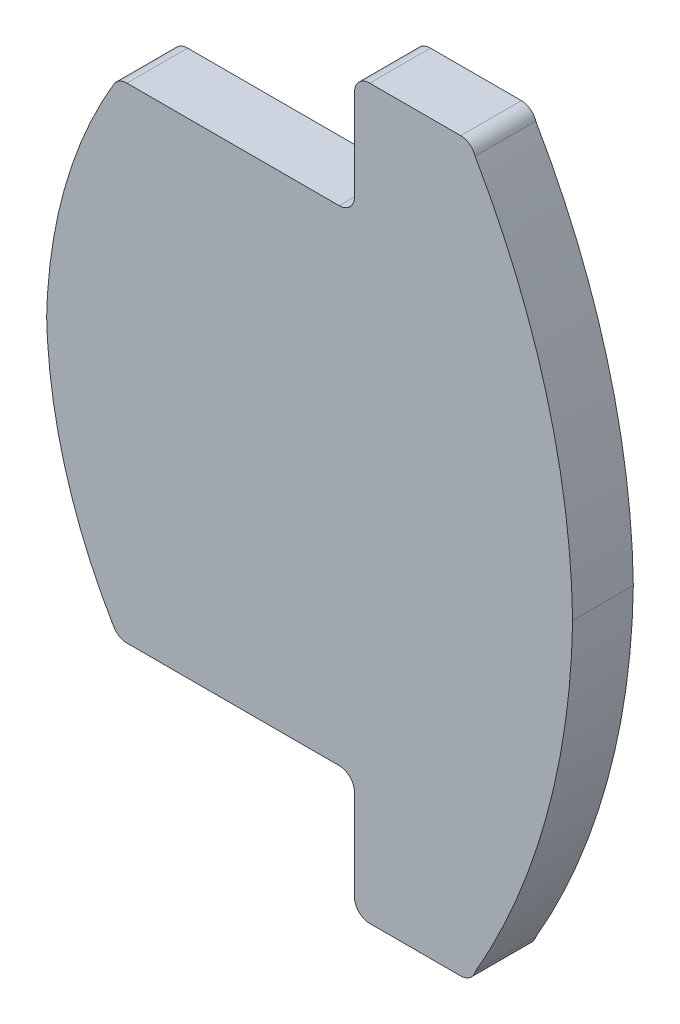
ISO-10303-21;
HEADER;
FILE_DESCRIPTION(('STEP AP214'),'2;1');
FILE_NAME('part.step','',(''),(''),'','','');
FILE_SCHEMA(('AUTOMOTIVE_DESIGN { 1 0 10303 214 1 1 1 1 }'));
ENDSEC;
DATA;
#1=APPLICATION_CONTEXT('core data for automotive mechanical design processes');
#2=APPLICATION_PROTOCOL_DEFINITION('international standard','automotive_design',2000,#1);
#3=PRODUCT_CONTEXT('',#1,'mechanical');
#4=PRODUCT('Part','Part','',(#3));
#5=PRODUCT_RELATED_PRODUCT_CATEGORY('part','',(#4));
#6=PRODUCT_DEFINITION_FORMATION('','',#4);
#7=PRODUCT_DEFINITION_CONTEXT('part definition',#1,'design');
#8=PRODUCT_DEFINITION('design','',#6,#7);
#9=PRODUCT_DEFINITION_SHAPE('','',#8);
#10=(LENGTH_UNIT() NAMED_UNIT(*) SI_UNIT(.MILLI.,.METRE.));
#11=(NAMED_UNIT(*) PLANE_ANGLE_UNIT() SI_UNIT($,.RADIAN.));
#12=(NAMED_UNIT(*) SI_UNIT($,.STERADIAN.) SOLID_ANGLE_UNIT());
#13=UNCERTAINTY_MEASURE_WITH_UNIT(LENGTH_MEASURE(1.E-05),#10,'distance_accuracy_value','');
#14=(GEOMETRIC_REPRESENTATION_CONTEXT(3) GLOBAL_UNCERTAINTY_ASSIGNED_CONTEXT((#13)) GLOBAL_UNIT_ASSIGNED_CONTEXT((#10,
#11,#12)) REPRESENTATION_CONTEXT('',''));
#15=CARTESIAN_POINT('',(0.,0.,0.));
#16=DIRECTION('',(0.,0.,1.));
#17=DIRECTION('',(1.,0.,0.));
#18=AXIS2_PLACEMENT_3D('',#15,#16,#17);
#19=CARTESIAN_POINT('',(6.3098886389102,-53.930587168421,12.7));
#20=DIRECTION('',(0.,0.,-1.));
#21=DIRECTION('',(-1.,0.,0.));
#22=AXIS2_PLACEMENT_3D('',#19,#20,#21);
#23=CYLINDRICAL_SURFACE('',#22,3.20040001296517);
#24=DIRECTION('',(0.,0.,1.));
#25=VECTOR('',#24,1.);
#26=CARTESIAN_POINT('',(6.30988865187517,-50.7301871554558,12.7));
#27=LINE('',#26,#25);
#28=CARTESIAN_POINT('',(6.30988865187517,-50.7301871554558,12.7));
#29=VERTEX_POINT('',#28);
#30=CARTESIAN_POINT('',(6.30988865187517,-50.7301871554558,25.4));
#31=VERTEX_POINT('',#30);
#32=EDGE_CURVE('E12',#29,#31,#27,.T.);
#33=ORIENTED_EDGE('',*,*,#32,.F.);
#34=CARTESIAN_POINT('',(6.3098886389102,-53.930587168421,12.7));
#35=DIRECTION('',(0.,0.,-1.));
#36=DIRECTION('',(-1.,0.,0.));
#37=AXIS2_PLACEMENT_3D('',#34,#35,#36);
#38=CIRCLE('',#37,3.20040001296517);
#39=CARTESIAN_POINT('',(9.51028865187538,-53.9305871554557,12.7));
#40=VERTEX_POINT('',#39);
#41=EDGE_CURVE('E259',#29,#40,#38,.T.);
#42=ORIENTED_EDGE('',*,*,#41,.T.);
#43=DIRECTION('',(0.,0.,1.));
#44=VECTOR('',#43,1.);
#45=CARTESIAN_POINT('',(9.51028865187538,-53.9305871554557,12.7));
#46=LINE('',#45,#44);
#47=CARTESIAN_POINT('',(9.51028865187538,-53.9305871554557,25.4));
#48=VERTEX_POINT('',#47);
#49=EDGE_CURVE('E31',#40,#48,#46,.T.);
#50=ORIENTED_EDGE('',*,*,#49,.T.);
#51=CARTESIAN_POINT('',(6.3098886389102,-53.930587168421,25.4));
#52=DIRECTION('',(0.,0.,-1.));
#53=DIRECTION('',(-1.,0.,0.));
#54=AXIS2_PLACEMENT_3D('',#51,#52,#53);
#55=CIRCLE('',#54,3.20040001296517);
#56=EDGE_CURVE('E268',#31,#48,#55,.T.);
#57=ORIENTED_EDGE('',*,*,#56,.F.);
#58=EDGE_LOOP('',(#33,#42,#50,#57));
#59=FACE_BOUND('',#58,.T.);
#60=ADVANCED_FACE('F20',(#59),#23,.F.);
#61=CARTESIAN_POINT('',(9.51028865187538,-72.9551871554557,12.7));
#62=DIRECTION('',(1.,0.,0.));
#63=DIRECTION('',(0.,-1.,0.));
#64=AXIS2_PLACEMENT_3D('',#61,#62,#63);
#65=PLANE('',#64);
#66=ORIENTED_EDGE('',*,*,#49,.F.);
#67=DIRECTION('',(0.,-1.,0.));
#68=VECTOR('',#67,1.);
#69=CARTESIAN_POINT('',(9.51028865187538,-72.9551871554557,12.7));
#70=LINE('',#69,#68);
#71=CARTESIAN_POINT('',(9.51028865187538,-72.9551871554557,12.7));
#72=VERTEX_POINT('',#71);
#73=EDGE_CURVE('E255',#40,#72,#70,.T.);
#74=ORIENTED_EDGE('',*,*,#73,.T.);
#75=DIRECTION('',(0.,0.,1.));
#76=VECTOR('',#75,1.);
#77=CARTESIAN_POINT('',(9.51028865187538,-72.9551871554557,12.7));
#78=LINE('',#77,#76);
#79=CARTESIAN_POINT('',(9.51028865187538,-72.9551871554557,25.4));
#80=VERTEX_POINT('',#79);
#81=EDGE_CURVE('E407',#72,#80,#78,.T.);
#82=ORIENTED_EDGE('',*,*,#81,.T.);
#83=DIRECTION('',(0.,1.,0.));
#84=VECTOR('',#83,1.);
#85=CARTESIAN_POINT('',(9.51028865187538,-47.5551871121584,25.4));
#86=LINE('',#85,#84);
#87=EDGE_CURVE('E272',#48,#80,#86,.F.);
#88=ORIENTED_EDGE('',*,*,#87,.F.);
#89=EDGE_LOOP('',(#66,#74,#82,#88));
#90=FACE_BOUND('',#89,.T.);
#91=ADVANCED_FACE('F421',(#90),#65,.F.);
#92=CARTESIAN_POINT('',(12.6852886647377,-72.9551871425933,12.7));
#93=DIRECTION('',(0.,0.,1.));
#94=DIRECTION('',(1.,0.,0.));
#95=AXIS2_PLACEMENT_3D('',#92,#93,#94);
#96=CYLINDRICAL_SURFACE('',#95,3.17500001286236);
#97=ORIENTED_EDGE('',*,*,#81,.F.);
#98=CARTESIAN_POINT('',(12.6852886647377,-72.9551871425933,12.7));
#99=DIRECTION('',(0.,0.,1.));
#100=DIRECTION('',(-1.,0.,0.));
#101=AXIS2_PLACEMENT_3D('',#98,#99,#100);
#102=CIRCLE('',#101,3.17500001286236);
#103=CARTESIAN_POINT('',(12.6852886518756,-76.1301871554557,12.7));
#104=VERTEX_POINT('',#103);
#105=EDGE_CURVE('E251',#72,#104,#102,.T.);
#106=ORIENTED_EDGE('',*,*,#105,.T.);
#107=DIRECTION('',(0.,0.,1.));
#108=VECTOR('',#107,1.);
#109=CARTESIAN_POINT('',(12.6852886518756,-76.1301871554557,12.7));
#110=LINE('',#109,#108);
#111=CARTESIAN_POINT('',(12.6852886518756,-76.1301871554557,25.4));
#112=VERTEX_POINT('',#111);
#113=EDGE_CURVE('E404',#104,#112,#110,.T.);
#114=ORIENTED_EDGE('',*,*,#113,.T.);
#115=CARTESIAN_POINT('',(12.6852886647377,-72.9551871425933,25.4));
#116=DIRECTION('',(0.,0.,1.));
#117=DIRECTION('',(1.,0.,0.));
#118=AXIS2_PLACEMENT_3D('',#115,#116,#117);
#119=CIRCLE('',#118,3.17500001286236);
#120=EDGE_CURVE('E278',#80,#112,#119,.T.);
#121=ORIENTED_EDGE('',*,*,#120,.F.);
#122=EDGE_LOOP('',(#97,#106,#114,#121));
#123=FACE_BOUND('',#122,.T.);
#124=ADVANCED_FACE('F429',(#123),#96,.T.);
#125=CARTESIAN_POINT('',(31.7352886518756,-76.1301871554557,12.7));
#126=DIRECTION('',(0.,1.,0.));
#127=DIRECTION('',(1.,0.,0.));
#128=AXIS2_PLACEMENT_3D('',#125,#126,#127);
#129=PLANE('',#128);
#130=ORIENTED_EDGE('',*,*,#113,.F.);
#131=DIRECTION('',(1.,0.,0.));
#132=VECTOR('',#131,1.);
#133=CARTESIAN_POINT('',(31.7352886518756,-76.1301871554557,12.7));
#134=LINE('',#133,#132);
#135=CARTESIAN_POINT('',(31.7352886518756,-76.1301871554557,12.7));
#136=VERTEX_POINT('',#135);
#137=EDGE_CURVE('E248',#104,#136,#134,.T.);
#138=ORIENTED_EDGE('',*,*,#137,.T.);
#139=DIRECTION('',(0.,0.,1.));
#140=VECTOR('',#139,1.);
#141=CARTESIAN_POINT('',(31.7352886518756,-76.1301871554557,12.7));
#142=LINE('',#141,#140);
#143=CARTESIAN_POINT('',(31.7352886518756,-76.1301871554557,25.4));
#144=VERTEX_POINT('',#143);
#145=EDGE_CURVE('E401',#136,#144,#142,.T.);
#146=ORIENTED_EDGE('',*,*,#145,.T.);
#147=DIRECTION('',(-1.,0.,0.));
#148=VECTOR('',#147,1.);
#149=CARTESIAN_POINT('',(-38.1147114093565,-76.1301871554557,25.4));
#150=LINE('',#149,#148);
#151=EDGE_CURVE('E282',#112,#144,#150,.F.);
#152=ORIENTED_EDGE('',*,*,#151,.F.);
#153=EDGE_LOOP('',(#130,#138,#146,#152));
#154=FACE_BOUND('',#153,.T.);
#155=ADVANCED_FACE('F432',(#154),#129,.F.);
#156=CARTESIAN_POINT('',(31.7126542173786,-72.9552635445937,12.7));
#157=DIRECTION('',(0.,0.,1.));
#158=DIRECTION('',(1.,0.,0.));
#159=AXIS2_PLACEMENT_3D('',#156,#157,#158);
#160=CYLINDRICAL_SURFACE('',#159,3.17500429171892);
#161=ORIENTED_EDGE('',*,*,#145,.F.);
#162=CARTESIAN_POINT('',(31.7126542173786,-72.9552635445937,12.7));
#163=DIRECTION('',(0.,0.,1.));
#164=DIRECTION('',(-1.,0.,0.));
#165=AXIS2_PLACEMENT_3D('',#162,#163,#164);
#166=CIRCLE('',#165,3.17500429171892);
#167=CARTESIAN_POINT('',(34.7442597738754,-73.8986722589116,12.7));
#168=VERTEX_POINT('',#167);
#169=EDGE_CURVE('E240',#136,#168,#166,.T.);
#170=ORIENTED_EDGE('',*,*,#169,.T.);
#171=DIRECTION('',(0.,0.,1.));
#172=VECTOR('',#171,1.);
#173=CARTESIAN_POINT('',(34.7442597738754,-73.8986722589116,12.7));
#174=LINE('',#173,#172);
#175=CARTESIAN_POINT('',(34.7442597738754,-73.8986722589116,25.4));
#176=VERTEX_POINT('',#175);
#177=EDGE_CURVE('E399',#168,#176,#174,.T.);
#178=ORIENTED_EDGE('',*,*,#177,.T.);
#179=CARTESIAN_POINT('',(31.7126542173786,-72.9552635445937,25.4));
#180=DIRECTION('',(0.,0.,1.));
#181=DIRECTION('',(1.,0.,0.));
#182=AXIS2_PLACEMENT_3D('',#179,#180,#181);
#183=CIRCLE('',#182,3.17500429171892);
#184=EDGE_CURVE('E284',#144,#176,#183,.T.);
#185=ORIENTED_EDGE('',*,*,#184,.F.);
#186=EDGE_LOOP('',(#161,#170,#178,#185));
#187=FACE_BOUND('',#186,.T.);
#188=ADVANCED_FACE('F438',(#187),#160,.T.);
#189=CARTESIAN_POINT('',(-97.2343581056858,2.30765966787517,12.7));
#190=DIRECTION('',(0.,0.,1.));
#191=DIRECTION('',(1.,0.,0.));
#192=AXIS2_PLACEMENT_3D('',#189,#190,#191);
#193=CYLINDRICAL_SURFACE('',#192,152.400001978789);
#194=ORIENTED_EDGE('',*,*,#177,.F.);
#195=CARTESIAN_POINT('',(-97.2343581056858,2.30765966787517,12.7));
#196=DIRECTION('',(0.,0.,1.));
#197=DIRECTION('',(-1.,0.,0.));
#198=AXIS2_PLACEMENT_3D('',#195,#196,#197);
#199=CIRCLE('',#198,152.400001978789);
#200=CARTESIAN_POINT('',(55.14817143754,0.,12.7));
#201=VERTEX_POINT('',#200);
#202=EDGE_CURVE('E236',#168,#201,#199,.T.);
#203=ORIENTED_EDGE('',*,*,#202,.T.);
#204=DIRECTION('',(0.,0.,1.));
#205=VECTOR('',#204,1.);
#206=CARTESIAN_POINT('',(55.14817143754,0.,12.7));
#207=LINE('',#206,#205);
#208=CARTESIAN_POINT('',(55.14817143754,0.,25.4));
#209=VERTEX_POINT('',#208);
#210=EDGE_CURVE('E391',#201,#209,#207,.T.);
#211=ORIENTED_EDGE('',*,*,#210,.T.);
#212=CARTESIAN_POINT('',(-97.2343581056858,2.30765966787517,25.4));
#213=DIRECTION('',(0.,0.,1.));
#214=DIRECTION('',(1.,0.,0.));
#215=AXIS2_PLACEMENT_3D('',#212,#213,#214);
#216=CIRCLE('',#215,152.400001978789);
#217=EDGE_CURVE('E288',#176,#209,#216,.T.);
#218=ORIENTED_EDGE('',*,*,#217,.F.);
#219=EDGE_LOOP('',(#194,#203,#211,#218));
#220=FACE_BOUND('',#219,.T.);
#221=ADVANCED_FACE('F444',(#220),#193,.T.);
#222=CARTESIAN_POINT('',(-97.2343581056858,-2.30765966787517,12.7));
#223=DIRECTION('',(0.,0.,1.));
#224=DIRECTION('',(1.,0.,0.));
#225=AXIS2_PLACEMENT_3D('',#222,#223,#224);
#226=CYLINDRICAL_SURFACE('',#225,152.400001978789);
#227=ORIENTED_EDGE('',*,*,#210,.F.);
#228=CARTESIAN_POINT('',(-97.2343581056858,-2.30765966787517,12.7));
#229=DIRECTION('',(0.,0.,1.));
#230=DIRECTION('',(1.,0.,0.));
#231=AXIS2_PLACEMENT_3D('',#228,#229,#230);
#232=CIRCLE('',#231,152.400001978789);
#233=CARTESIAN_POINT('',(34.7442597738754,73.8986722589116,12.7));
#234=VERTEX_POINT('',#233);
#235=EDGE_CURVE('E232',#201,#234,#232,.T.);
#236=ORIENTED_EDGE('',*,*,#235,.T.);
#237=DIRECTION('',(0.,0.,1.));
#238=VECTOR('',#237,1.);
#239=CARTESIAN_POINT('',(34.7442597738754,73.8986722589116,12.7));
#240=LINE('',#239,#238);
#241=CARTESIAN_POINT('',(34.7442597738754,73.8986722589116,25.4));
#242=VERTEX_POINT('',#241);
#243=EDGE_CURVE('E388',#234,#242,#240,.T.);
#244=ORIENTED_EDGE('',*,*,#243,.T.);
#245=CARTESIAN_POINT('',(-97.2343581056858,-2.30765966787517,25.4));
#246=DIRECTION('',(0.,0.,1.));
#247=DIRECTION('',(1.,0.,0.));
#248=AXIS2_PLACEMENT_3D('',#245,#246,#247);
#249=CIRCLE('',#248,152.400001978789);
#250=EDGE_CURVE('E292',#209,#242,#249,.T.);
#251=ORIENTED_EDGE('',*,*,#250,.F.);
#252=EDGE_LOOP('',(#227,#236,#244,#251));
#253=FACE_BOUND('',#252,.T.);
#254=ADVANCED_FACE('F446',(#253),#226,.T.);
#255=CARTESIAN_POINT('',(31.7126542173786,72.9552635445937,12.7));
#256=DIRECTION('',(0.,0.,1.));
#257=DIRECTION('',(1.,0.,0.));
#258=AXIS2_PLACEMENT_3D('',#255,#256,#257);
#259=CYLINDRICAL_SURFACE('',#258,3.17500429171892);
#260=ORIENTED_EDGE('',*,*,#243,.F.);
#261=CARTESIAN_POINT('',(31.7126542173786,72.9552635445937,12.7));
#262=DIRECTION('',(0.,0.,1.));
#263=DIRECTION('',(1.,0.,0.));
#264=AXIS2_PLACEMENT_3D('',#261,#262,#263);
#265=CIRCLE('',#264,3.17500429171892);
#266=CARTESIAN_POINT('',(31.7352886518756,76.1301871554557,12.7));
#267=VERTEX_POINT('',#266);
#268=EDGE_CURVE('E229',#234,#267,#265,.T.);
#269=ORIENTED_EDGE('',*,*,#268,.T.);
#270=DIRECTION('',(0.,0.,1.));
#271=VECTOR('',#270,1.);
#272=CARTESIAN_POINT('',(31.7352886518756,76.1301871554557,12.7));
#273=LINE('',#272,#271);
#274=CARTESIAN_POINT('',(31.7352886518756,76.1301871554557,25.4));
#275=VERTEX_POINT('',#274);
#276=EDGE_CURVE('E385',#267,#275,#273,.T.);
#277=ORIENTED_EDGE('',*,*,#276,.T.);
#278=CARTESIAN_POINT('',(31.7126542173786,72.9552635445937,25.4));
#279=DIRECTION('',(0.,0.,1.));
#280=DIRECTION('',(1.,0.,0.));
#281=AXIS2_PLACEMENT_3D('',#278,#279,#280);
#282=CIRCLE('',#281,3.17500429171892);
#283=EDGE_CURVE('E300',#242,#275,#282,.T.);
#284=ORIENTED_EDGE('',*,*,#283,.F.);
#285=EDGE_LOOP('',(#260,#269,#277,#284));
#286=FACE_BOUND('',#285,.T.);
#287=ADVANCED_FACE('F452',(#286),#259,.T.);
#288=CARTESIAN_POINT('',(31.7352886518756,76.1301871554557,12.7));
#289=DIRECTION('',(0.,-1.,0.));
#290=DIRECTION('',(-1.,0.,0.));
#291=AXIS2_PLACEMENT_3D('',#288,#289,#290);
#292=PLANE('',#291);
#293=ORIENTED_EDGE('',*,*,#276,.F.);
#294=DIRECTION('',(-1.,0.,0.));
#295=VECTOR('',#294,1.);
#296=CARTESIAN_POINT('',(31.7352886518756,76.1301871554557,12.7));
#297=LINE('',#296,#295);
#298=CARTESIAN_POINT('',(12.6852886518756,76.1301871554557,12.7));
#299=VERTEX_POINT('',#298);
#300=EDGE_CURVE('E221',#267,#299,#297,.T.);
#301=ORIENTED_EDGE('',*,*,#300,.T.);
#302=DIRECTION('',(0.,0.,1.));
#303=VECTOR('',#302,1.);
#304=CARTESIAN_POINT('',(12.6852886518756,76.1301871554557,12.7));
#305=LINE('',#304,#303);
#306=CARTESIAN_POINT('',(12.6852886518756,76.1301871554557,25.4));
#307=VERTEX_POINT('',#306);
#308=EDGE_CURVE('E383',#299,#307,#305,.T.);
#309=ORIENTED_EDGE('',*,*,#308,.T.);
#310=DIRECTION('',(-1.,0.,0.));
#311=VECTOR('',#310,1.);
#312=CARTESIAN_POINT('',(-38.1147114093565,76.1301871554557,25.4));
#313=LINE('',#312,#311);
#314=EDGE_CURVE('E303',#275,#307,#313,.T.);
#315=ORIENTED_EDGE('',*,*,#314,.F.);
#316=EDGE_LOOP('',(#293,#301,#309,#315));
#317=FACE_BOUND('',#316,.T.);
#318=ADVANCED_FACE('F457',(#317),#292,.F.);
#319=CARTESIAN_POINT('',(12.6852886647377,72.9551871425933,12.7));
#320=DIRECTION('',(0.,0.,1.));
#321=DIRECTION('',(1.,0.,0.));
#322=AXIS2_PLACEMENT_3D('',#319,#320,#321);
#323=CYLINDRICAL_SURFACE('',#322,3.17500001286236);
#324=ORIENTED_EDGE('',*,*,#308,.F.);
#325=CARTESIAN_POINT('',(12.6852886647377,72.9551871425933,12.7));
#326=DIRECTION('',(0.,0.,1.));
#327=DIRECTION('',(1.,0.,0.));
#328=AXIS2_PLACEMENT_3D('',#325,#326,#327);
#329=CIRCLE('',#328,3.17500001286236);
#330=CARTESIAN_POINT('',(9.51028865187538,72.9551871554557,12.7));
#331=VERTEX_POINT('',#330);
#332=EDGE_CURVE('E217',#299,#331,#329,.T.);
#333=ORIENTED_EDGE('',*,*,#332,.T.);
#334=DIRECTION('',(0.,0.,1.));
#335=VECTOR('',#334,1.);
#336=CARTESIAN_POINT('',(9.51028865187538,72.9551871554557,12.7));
#337=LINE('',#336,#335);
#338=CARTESIAN_POINT('',(9.51028865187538,72.9551871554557,25.4));
#339=VERTEX_POINT('',#338);
#340=EDGE_CURVE('E375',#331,#339,#337,.T.);
#341=ORIENTED_EDGE('',*,*,#340,.T.);
#342=CARTESIAN_POINT('',(12.6852886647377,72.9551871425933,25.4));
#343=DIRECTION('',(0.,0.,1.));
#344=DIRECTION('',(1.,0.,0.));
#345=AXIS2_PLACEMENT_3D('',#342,#343,#344);
#346=CIRCLE('',#345,3.17500001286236);
#347=EDGE_CURVE('E307',#307,#339,#346,.T.);
#348=ORIENTED_EDGE('',*,*,#347,.F.);
#349=EDGE_LOOP('',(#324,#333,#341,#348));
#350=FACE_BOUND('',#349,.T.);
#351=ADVANCED_FACE('F459',(#350),#323,.T.);
#352=CARTESIAN_POINT('',(9.51028865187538,72.9551871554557,12.7));
#353=DIRECTION('',(1.,0.,0.));
#354=DIRECTION('',(0.,-1.,0.));
#355=AXIS2_PLACEMENT_3D('',#352,#353,#354);
#356=PLANE('',#355);
#357=ORIENTED_EDGE('',*,*,#340,.F.);
#358=DIRECTION('',(0.,-1.,0.));
#359=VECTOR('',#358,1.);
#360=CARTESIAN_POINT('',(9.51028865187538,72.9551871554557,12.7));
#361=LINE('',#360,#359);
#362=CARTESIAN_POINT('',(9.51028865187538,53.9305871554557,12.7));
#363=VERTEX_POINT('',#362);
#364=EDGE_CURVE('E213',#331,#363,#361,.T.);
#365=ORIENTED_EDGE('',*,*,#364,.T.);
#366=DIRECTION('',(0.,0.,1.));
#367=VECTOR('',#366,1.);
#368=CARTESIAN_POINT('',(9.51028865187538,53.9305871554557,12.7));
#369=LINE('',#368,#367);
#370=CARTESIAN_POINT('',(9.51028865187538,53.9305871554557,25.4));
#371=VERTEX_POINT('',#370);
#372=EDGE_CURVE('E372',#363,#371,#369,.T.);
#373=ORIENTED_EDGE('',*,*,#372,.T.);
#374=DIRECTION('',(0.,1.,0.));
#375=VECTOR('',#374,1.);
#376=CARTESIAN_POINT('',(9.51028865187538,-47.5551871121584,25.4));
#377=LINE('',#376,#375);
#378=EDGE_CURVE('E311',#339,#371,#377,.F.);
#379=ORIENTED_EDGE('',*,*,#378,.F.);
#380=EDGE_LOOP('',(#357,#365,#373,#379));
#381=FACE_BOUND('',#380,.T.);
#382=ADVANCED_FACE('F464',(#381),#356,.F.);
#383=CARTESIAN_POINT('',(6.3098886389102,53.930587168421,12.7));
#384=DIRECTION('',(0.,0.,-1.));
#385=DIRECTION('',(-1.,0.,0.));
#386=AXIS2_PLACEMENT_3D('',#383,#384,#385);
#387=CYLINDRICAL_SURFACE('',#386,3.20040001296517);
#388=ORIENTED_EDGE('',*,*,#372,.F.);
#389=CARTESIAN_POINT('',(6.3098886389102,53.930587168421,12.7));
#390=DIRECTION('',(0.,0.,-1.));
#391=DIRECTION('',(1.,0.,0.));
#392=AXIS2_PLACEMENT_3D('',#389,#390,#391);
#393=CIRCLE('',#392,3.20040001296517);
#394=CARTESIAN_POINT('',(6.30988865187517,50.7301871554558,12.7));
#395=VERTEX_POINT('',#394);
#396=EDGE_CURVE('E210',#363,#395,#393,.T.);
#397=ORIENTED_EDGE('',*,*,#396,.T.);
#398=DIRECTION('',(0.,0.,1.));
#399=VECTOR('',#398,1.);
#400=CARTESIAN_POINT('',(6.30988865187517,50.7301871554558,12.7));
#401=LINE('',#400,#399);
#402=CARTESIAN_POINT('',(6.30988865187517,50.7301871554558,25.4));
#403=VERTEX_POINT('',#402);
#404=EDGE_CURVE('E369',#395,#403,#401,.T.);
#405=ORIENTED_EDGE('',*,*,#404,.T.);
#406=CARTESIAN_POINT('',(6.3098886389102,53.930587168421,25.4));
#407=DIRECTION('',(0.,0.,-1.));
#408=DIRECTION('',(-1.,0.,0.));
#409=AXIS2_PLACEMENT_3D('',#406,#407,#408);
#410=CIRCLE('',#409,3.20040001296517);
#411=EDGE_CURVE('E317',#371,#403,#410,.T.);
#412=ORIENTED_EDGE('',*,*,#411,.F.);
#413=EDGE_LOOP('',(#388,#397,#405,#412));
#414=FACE_BOUND('',#413,.T.);
#415=ADVANCED_FACE('F470',(#414),#387,.F.);
#416=CARTESIAN_POINT('',(6.30988865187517,50.7301871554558,12.7));
#417=DIRECTION('',(0.,-1.,0.));
#418=DIRECTION('',(-1.,0.,0.));
#419=AXIS2_PLACEMENT_3D('',#416,#417,#418);
#420=PLANE('',#419);
#421=ORIENTED_EDGE('',*,*,#404,.F.);
#422=DIRECTION('',(-1.,0.,0.));
#423=VECTOR('',#422,1.);
#424=CARTESIAN_POINT('',(6.30988865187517,50.7301871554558,12.7));
#425=LINE('',#424,#423);
#426=CARTESIAN_POINT('',(-38.1147113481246,50.7301871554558,12.7));
#427=VERTEX_POINT('',#426);
#428=EDGE_CURVE('E202',#395,#427,#425,.T.);
#429=ORIENTED_EDGE('',*,*,#428,.T.);
#430=DIRECTION('',(0.,0.,1.));
#431=VECTOR('',#430,1.);
#432=CARTESIAN_POINT('',(-38.1147113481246,50.7301871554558,12.7));
#433=LINE('',#432,#431);
#434=CARTESIAN_POINT('',(-38.1147113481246,50.7301871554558,25.4));
#435=VERTEX_POINT('',#434);
#436=EDGE_CURVE('E367',#427,#435,#433,.T.);
#437=ORIENTED_EDGE('',*,*,#436,.T.);
#438=DIRECTION('',(-1.,0.,0.));
#439=VECTOR('',#438,1.);
#440=CARTESIAN_POINT('',(-38.1147114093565,50.7301871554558,25.4));
#441=LINE('',#440,#439);
#442=EDGE_CURVE('E320',#403,#435,#441,.T.);
#443=ORIENTED_EDGE('',*,*,#442,.F.);
#444=EDGE_LOOP('',(#421,#429,#437,#443));
#445=FACE_BOUND('',#444,.T.);
#446=ADVANCED_FACE('F473',(#445),#420,.F.);
#447=CARTESIAN_POINT('',(-38.1147114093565,47.5551871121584,12.7));
#448=DIRECTION('',(0.,0.,1.));
#449=DIRECTION('',(1.,0.,0.));
#450=AXIS2_PLACEMENT_3D('',#447,#448,#449);
#451=CYLINDRICAL_SURFACE('',#450,3.17500004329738);
#452=ORIENTED_EDGE('',*,*,#436,.F.);
#453=CARTESIAN_POINT('',(-38.1147114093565,47.5551871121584,12.7));
#454=DIRECTION('',(0.,0.,1.));
#455=DIRECTION('',(1.,0.,0.));
#456=AXIS2_PLACEMENT_3D('',#453,#454,#455);
#457=CIRCLE('',#456,3.17500004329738);
#458=CARTESIAN_POINT('',(-40.8560929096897,49.1568901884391,12.7));
#459=VERTEX_POINT('',#458);
#460=EDGE_CURVE('E198',#427,#459,#457,.T.);
#461=ORIENTED_EDGE('',*,*,#460,.T.);
#462=DIRECTION('',(0.,0.,1.));
#463=VECTOR('',#462,1.);
#464=CARTESIAN_POINT('',(-40.8560929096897,49.1568901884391,12.7));
#465=LINE('',#464,#463);
#466=CARTESIAN_POINT('',(-40.8560929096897,49.1568901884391,25.4));
#467=VERTEX_POINT('',#466);
#468=EDGE_CURVE('E359',#459,#467,#465,.T.);
#469=ORIENTED_EDGE('',*,*,#468,.T.);
#470=CARTESIAN_POINT('',(-38.1147114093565,47.5551871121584,25.4));
#471=DIRECTION('',(0.,0.,1.));
#472=DIRECTION('',(1.,0.,0.));
#473=AXIS2_PLACEMENT_3D('',#470,#471,#472);
#474=CIRCLE('',#473,3.17500004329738);
#475=EDGE_CURVE('E324',#435,#467,#474,.T.);
#476=ORIENTED_EDGE('',*,*,#475,.F.);
#477=EDGE_LOOP('',(#452,#461,#469,#476));
#478=FACE_BOUND('',#477,.T.);
#479=ADVANCED_FACE('F478',(#478),#451,.T.);
#480=CARTESIAN_POINT('',(45.6895199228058,-2.14408989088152,12.7));
#481=DIRECTION('',(0.,0.,1.));
#482=DIRECTION('',(1.,0.,0.));
#483=AXIS2_PLACEMENT_3D('',#480,#481,#482);
#484=CYLINDRICAL_SURFACE('',#483,100.607821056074);
#485=ORIENTED_EDGE('',*,*,#468,.F.);
#486=CARTESIAN_POINT('',(45.6895199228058,-2.14408989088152,12.7));
#487=DIRECTION('',(0.,0.,1.));
#488=DIRECTION('',(1.,0.,0.));
#489=AXIS2_PLACEMENT_3D('',#486,#487,#488);
#490=CIRCLE('',#489,100.607821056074);
#491=CARTESIAN_POINT('',(-54.7102315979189,4.32302323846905,12.7));
#492=VERTEX_POINT('',#491);
#493=EDGE_CURVE('E194',#459,#492,#490,.T.);
#494=ORIENTED_EDGE('',*,*,#493,.T.);
#495=DIRECTION('',(0.,0.,1.));
#496=VECTOR('',#495,1.);
#497=CARTESIAN_POINT('',(-54.7102315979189,4.32302323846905,12.7));
#498=LINE('',#497,#496);
#499=CARTESIAN_POINT('',(-54.7102315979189,4.32302323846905,25.4));
#500=VERTEX_POINT('',#499);
#501=EDGE_CURVE('E356',#492,#500,#498,.T.);
#502=ORIENTED_EDGE('',*,*,#501,.T.);
#503=CARTESIAN_POINT('',(45.6895199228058,-2.14408989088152,25.4));
#504=DIRECTION('',(0.,0.,1.));
#505=DIRECTION('',(1.,0.,0.));
#506=AXIS2_PLACEMENT_3D('',#503,#504,#505);
#507=CIRCLE('',#506,100.607821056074);
#508=EDGE_CURVE('E328',#467,#500,#507,.T.);
#509=ORIENTED_EDGE('',*,*,#508,.F.);
#510=EDGE_LOOP('',(#485,#494,#502,#509));
#511=FACE_BOUND('',#510,.T.);
#512=ADVANCED_FACE('F484',(#511),#484,.T.);
#513=CARTESIAN_POINT('',(46.679655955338,-2.20786815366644,12.7));
#514=DIRECTION('',(0.,0.,1.));
#515=DIRECTION('',(1.,0.,0.));
#516=AXIS2_PLACEMENT_3D('',#513,#514,#515);
#517=CYLINDRICAL_SURFACE('',#516,101.600009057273);
#518=ORIENTED_EDGE('',*,*,#501,.F.);
#519=CARTESIAN_POINT('',(46.679655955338,-2.20786815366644,12.7));
#520=DIRECTION('',(0.,0.,1.));
#521=DIRECTION('',(-1.,0.,0.));
#522=AXIS2_PLACEMENT_3D('',#519,#520,#521);
#523=CIRCLE('',#522,101.600009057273);
#524=CARTESIAN_POINT('',(-54.8963606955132,0.,12.7));
#525=VERTEX_POINT('',#524);
#526=EDGE_CURVE('E177',#492,#525,#523,.T.);
#527=ORIENTED_EDGE('',*,*,#526,.T.);
#528=DIRECTION('',(0.,0.,1.));
#529=VECTOR('',#528,1.);
#530=CARTESIAN_POINT('',(-54.8963606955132,0.,12.7));
#531=LINE('',#530,#529);
#532=CARTESIAN_POINT('',(-54.8963606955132,0.,25.4));
#533=VERTEX_POINT('',#532);
#534=EDGE_CURVE('E353',#525,#533,#531,.T.);
#535=ORIENTED_EDGE('',*,*,#534,.T.);
#536=CARTESIAN_POINT('',(46.679655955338,-2.20786815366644,25.4));
#537=DIRECTION('',(0.,0.,1.));
#538=DIRECTION('',(1.,0.,0.));
#539=AXIS2_PLACEMENT_3D('',#536,#537,#538);
#540=CIRCLE('',#539,101.600009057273);
#541=EDGE_CURVE('E336',#500,#533,#540,.T.);
#542=ORIENTED_EDGE('',*,*,#541,.F.);
#543=EDGE_LOOP('',(#518,#527,#535,#542));
#544=FACE_BOUND('',#543,.T.);
#545=ADVANCED_FACE('F486',(#544),#517,.T.);
#546=CARTESIAN_POINT('',(46.679655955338,2.20786815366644,12.7));
#547=DIRECTION('',(0.,0.,1.));
#548=DIRECTION('',(1.,0.,0.));
#549=AXIS2_PLACEMENT_3D('',#546,#547,#548);
#550=CYLINDRICAL_SURFACE('',#549,101.600009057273);
#551=ORIENTED_EDGE('',*,*,#534,.F.);
#552=CARTESIAN_POINT('',(46.679655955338,2.20786815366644,12.7));
#553=DIRECTION('',(0.,0.,1.));
#554=DIRECTION('',(1.,0.,0.));
#555=AXIS2_PLACEMENT_3D('',#552,#553,#554);
#556=CIRCLE('',#555,101.600009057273);
#557=CARTESIAN_POINT('',(-54.7102315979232,-4.323023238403,12.7));
#558=VERTEX_POINT('',#557);
#559=EDGE_CURVE('E173',#525,#558,#556,.T.);
#560=ORIENTED_EDGE('',*,*,#559,.T.);
#561=DIRECTION('',(0.,0.,1.));
#562=VECTOR('',#561,1.);
#563=CARTESIAN_POINT('',(-54.7102315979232,-4.323023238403,12.7));
#564=LINE('',#563,#562);
#565=CARTESIAN_POINT('',(-54.7102315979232,-4.323023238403,25.4));
#566=VERTEX_POINT('',#565);
#567=EDGE_CURVE('E152',#558,#566,#564,.T.);
#568=ORIENTED_EDGE('',*,*,#567,.T.);
#569=CARTESIAN_POINT('',(46.679655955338,2.20786815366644,25.4));
#570=DIRECTION('',(0.,0.,1.));
#571=DIRECTION('',(1.,0.,0.));
#572=AXIS2_PLACEMENT_3D('',#569,#570,#571);
#573=CIRCLE('',#572,101.600009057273);
#574=EDGE_CURVE('E339',#533,#566,#573,.T.);
#575=ORIENTED_EDGE('',*,*,#574,.F.);
#576=EDGE_LOOP('',(#551,#560,#568,#575));
#577=FACE_BOUND('',#576,.T.);
#578=ADVANCED_FACE('F488',(#577),#550,.T.);
#579=CARTESIAN_POINT('',(45.6895199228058,2.14408989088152,12.7));
#580=DIRECTION('',(0.,0.,1.));
#581=DIRECTION('',(1.,0.,0.));
#582=AXIS2_PLACEMENT_3D('',#579,#580,#581);
#583=CYLINDRICAL_SURFACE('',#582,100.607821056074);
#584=ORIENTED_EDGE('',*,*,#567,.F.);
#585=CARTESIAN_POINT('',(45.6895199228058,2.14408989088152,12.7));
#586=DIRECTION('',(0.,0.,1.));
#587=DIRECTION('',(-1.,0.,0.));
#588=AXIS2_PLACEMENT_3D('',#585,#586,#587);
#589=CIRCLE('',#588,100.607821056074);
#590=CARTESIAN_POINT('',(-40.8560929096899,-49.1568901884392,12.7));
#591=VERTEX_POINT('',#590);
#592=EDGE_CURVE('E168',#558,#591,#589,.T.);
#593=ORIENTED_EDGE('',*,*,#592,.T.);
#594=DIRECTION('',(0.,0.,1.));
#595=VECTOR('',#594,1.);
#596=CARTESIAN_POINT('',(-40.8560929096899,-49.1568901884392,12.7));
#597=LINE('',#596,#595);
#598=CARTESIAN_POINT('',(-40.8560929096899,-49.1568901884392,25.4));
#599=VERTEX_POINT('',#598);
#600=EDGE_CURVE('E39',#591,#599,#597,.T.);
#601=ORIENTED_EDGE('',*,*,#600,.T.);
#602=CARTESIAN_POINT('',(45.6895199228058,2.14408989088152,25.4));
#603=DIRECTION('',(0.,0.,1.));
#604=DIRECTION('',(1.,0.,0.));
#605=AXIS2_PLACEMENT_3D('',#602,#603,#604);
#606=CIRCLE('',#605,100.607821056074);
#607=EDGE_CURVE('E343',#566,#599,#606,.T.);
#608=ORIENTED_EDGE('',*,*,#607,.F.);
#609=EDGE_LOOP('',(#584,#593,#601,#608));
#610=FACE_BOUND('',#609,.T.);
#611=ADVANCED_FACE('F172',(#610),#583,.T.);
#612=CARTESIAN_POINT('',(-38.1147114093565,-47.5551871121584,12.7));
#613=DIRECTION('',(0.,0.,1.));
#614=DIRECTION('',(1.,0.,0.));
#615=AXIS2_PLACEMENT_3D('',#612,#613,#614);
#616=CYLINDRICAL_SURFACE('',#615,3.17500004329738);
#617=ORIENTED_EDGE('',*,*,#600,.F.);
#618=CARTESIAN_POINT('',(-38.1147114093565,-47.5551871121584,12.7));
#619=DIRECTION('',(0.,0.,1.));
#620=DIRECTION('',(-1.,0.,0.));
#621=AXIS2_PLACEMENT_3D('',#618,#619,#620);
#622=CIRCLE('',#621,3.17500004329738);
#623=CARTESIAN_POINT('',(-38.1147113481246,-50.7301871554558,12.7));
#624=VERTEX_POINT('',#623);
#625=EDGE_CURVE('E158',#591,#624,#622,.T.);
#626=ORIENTED_EDGE('',*,*,#625,.T.);
#627=DIRECTION('',(0.,0.,1.));
#628=VECTOR('',#627,1.);
#629=CARTESIAN_POINT('',(-38.1147113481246,-50.7301871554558,12.7));
#630=LINE('',#629,#628);
#631=CARTESIAN_POINT('',(-38.1147113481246,-50.7301871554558,25.4));
#632=VERTEX_POINT('',#631);
#633=EDGE_CURVE('E24',#624,#632,#630,.T.);
#634=ORIENTED_EDGE('',*,*,#633,.T.);
#635=CARTESIAN_POINT('',(-38.1147114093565,-47.5551871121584,25.4));
#636=DIRECTION('',(0.,0.,1.));
#637=DIRECTION('',(1.,0.,0.));
#638=AXIS2_PLACEMENT_3D('',#635,#636,#637);
#639=CIRCLE('',#638,3.17500004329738);
#640=EDGE_CURVE('E160',#599,#632,#639,.T.);
#641=ORIENTED_EDGE('',*,*,#640,.F.);
#642=EDGE_LOOP('',(#617,#626,#634,#641));
#643=FACE_BOUND('',#642,.T.);
#644=ADVANCED_FACE('F157',(#643),#616,.T.);
#645=CARTESIAN_POINT('',(6.30988865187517,-50.7301871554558,12.7));
#646=DIRECTION('',(0.,1.,0.));
#647=DIRECTION('',(1.,0.,0.));
#648=AXIS2_PLACEMENT_3D('',#645,#646,#647);
#649=PLANE('',#648);
#650=DIRECTION('',(1.,0.,0.));
#651=VECTOR('',#650,1.);
#652=CARTESIAN_POINT('',(6.30988865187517,-50.7301871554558,12.7));
#653=LINE('',#652,#651);
#654=EDGE_CURVE('E171',#624,#29,#653,.T.);
#655=ORIENTED_EDGE('',*,*,#654,.T.);
#656=ORIENTED_EDGE('',*,*,#32,.T.);
#657=DIRECTION('',(-1.,0.,0.));
#658=VECTOR('',#657,1.);
#659=CARTESIAN_POINT('',(-38.1147114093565,-50.7301871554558,25.4));
#660=LINE('',#659,#658);
#661=EDGE_CURVE('E175',#632,#31,#660,.F.);
#662=ORIENTED_EDGE('',*,*,#661,.F.);
#663=ORIENTED_EDGE('',*,*,#633,.F.);
#664=EDGE_LOOP('',(#655,#656,#662,#663));
#665=FACE_BOUND('',#664,.T.);
#666=ADVANCED_FACE('F22',(#665),#649,.F.);
#667=CARTESIAN_POINT('',(-38.1147114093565,-47.5551871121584,25.4));
#668=DIRECTION('',(0.,0.,-1.));
#669=DIRECTION('',(-1.,0.,0.));
#670=AXIS2_PLACEMENT_3D('',#667,#668,#669);
#671=PLANE('',#670);
#672=ORIENTED_EDGE('',*,*,#640,.T.);
#673=ORIENTED_EDGE('',*,*,#661,.T.);
#674=ORIENTED_EDGE('',*,*,#56,.T.);
#675=ORIENTED_EDGE('',*,*,#87,.T.);
#676=ORIENTED_EDGE('',*,*,#120,.T.);
#677=ORIENTED_EDGE('',*,*,#151,.T.);
#678=ORIENTED_EDGE('',*,*,#184,.T.);
#679=ORIENTED_EDGE('',*,*,#217,.T.);
#680=ORIENTED_EDGE('',*,*,#250,.T.);
#681=ORIENTED_EDGE('',*,*,#283,.T.);
#682=ORIENTED_EDGE('',*,*,#314,.T.);
#683=ORIENTED_EDGE('',*,*,#347,.T.);
#684=ORIENTED_EDGE('',*,*,#378,.T.);
#685=ORIENTED_EDGE('',*,*,#411,.T.);
#686=ORIENTED_EDGE('',*,*,#442,.T.);
#687=ORIENTED_EDGE('',*,*,#475,.T.);
#688=ORIENTED_EDGE('',*,*,#508,.T.);
#689=ORIENTED_EDGE('',*,*,#541,.T.);
#690=ORIENTED_EDGE('',*,*,#574,.T.);
#691=ORIENTED_EDGE('',*,*,#607,.T.);
#692=EDGE_LOOP('',(#672,#673,#674,#675,#676,#677,#678,#679,#680,#681,#682,#683,#684,#685,#686,
#687,#688,#689,#690,#691));
#693=FACE_BOUND('',#692,.T.);
#694=ADVANCED_FACE('F427',(#693),#671,.F.);
#695=CARTESIAN_POINT('',(-38.1147114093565,-47.5551871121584,12.7));
#696=DIRECTION('',(0.,0.,-1.));
#697=DIRECTION('',(-1.,0.,0.));
#698=AXIS2_PLACEMENT_3D('',#695,#696,#697);
#699=PLANE('',#698);
#700=ORIENTED_EDGE('',*,*,#625,.F.);
#701=ORIENTED_EDGE('',*,*,#592,.F.);
#702=ORIENTED_EDGE('',*,*,#559,.F.);
#703=ORIENTED_EDGE('',*,*,#526,.F.);
#704=ORIENTED_EDGE('',*,*,#493,.F.);
#705=ORIENTED_EDGE('',*,*,#460,.F.);
#706=ORIENTED_EDGE('',*,*,#428,.F.);
#707=ORIENTED_EDGE('',*,*,#396,.F.);
#708=ORIENTED_EDGE('',*,*,#364,.F.);
#709=ORIENTED_EDGE('',*,*,#332,.F.);
#710=ORIENTED_EDGE('',*,*,#300,.F.);
#711=ORIENTED_EDGE('',*,*,#268,.F.);
#712=ORIENTED_EDGE('',*,*,#235,.F.);
#713=ORIENTED_EDGE('',*,*,#202,.F.);
#714=ORIENTED_EDGE('',*,*,#169,.F.);
#715=ORIENTED_EDGE('',*,*,#137,.F.);
#716=ORIENTED_EDGE('',*,*,#105,.F.);
#717=ORIENTED_EDGE('',*,*,#73,.F.);
#718=ORIENTED_EDGE('',*,*,#41,.F.);
#719=ORIENTED_EDGE('',*,*,#654,.F.);
#720=EDGE_LOOP('',(#700,#701,#702,#703,#704,#705,#706,#707,#708,#709,#710,#711,#712,#713,#714,
#715,#716,#717,#718,#719));
#721=FACE_BOUND('',#720,.T.);
#722=ADVANCED_FACE('F166',(#721),#699,.T.);
#723=CLOSED_SHELL('',(#60,#91,#124,#155,#188,#221,#254,#287,#318,#351,#382,#415,#446,#479,#512,
#545,#578,#611,#644,#666,#694,#722));
#724=MANIFOLD_SOLID_BREP('B1',#723);
#725=ADVANCED_BREP_SHAPE_REPRESENTATION('',(#18,#724),#14);
#726=SHAPE_DEFINITION_REPRESENTATION(#9,#725);
ENDSEC;
END-ISO-10303-21;
